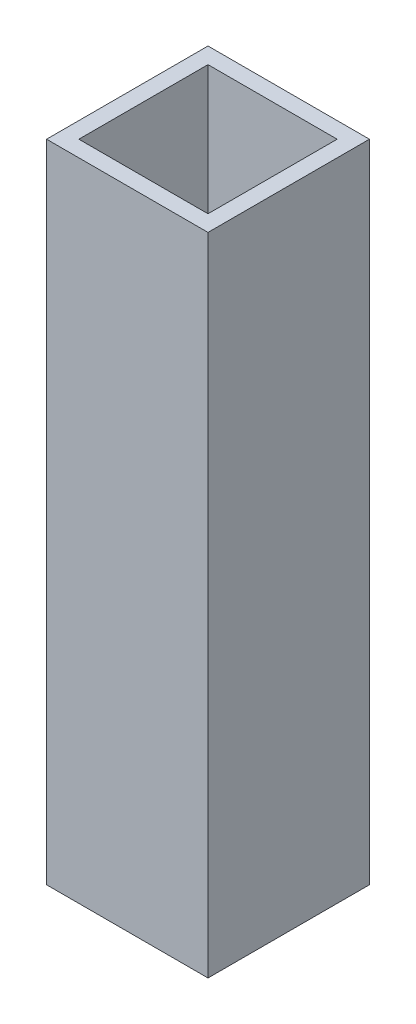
ISO-10303-21;
HEADER;
FILE_DESCRIPTION(('STEP AP214'),'2;1');
FILE_NAME('part.step','',(''),(''),'','','');
FILE_SCHEMA(('AUTOMOTIVE_DESIGN { 1 0 10303 214 1 1 1 1 }'));
ENDSEC;
DATA;
#1=APPLICATION_CONTEXT('core data for automotive mechanical design processes');
#2=APPLICATION_PROTOCOL_DEFINITION('international standard','automotive_design',2000,#1);
#3=PRODUCT_CONTEXT('',#1,'mechanical');
#4=PRODUCT('Part','Part','',(#3));
#5=PRODUCT_RELATED_PRODUCT_CATEGORY('part','',(#4));
#6=PRODUCT_DEFINITION_FORMATION('','',#4);
#7=PRODUCT_DEFINITION_CONTEXT('part definition',#1,'design');
#8=PRODUCT_DEFINITION('design','',#6,#7);
#9=PRODUCT_DEFINITION_SHAPE('','',#8);
#10=(LENGTH_UNIT() NAMED_UNIT(*) SI_UNIT(.MILLI.,.METRE.));
#11=(NAMED_UNIT(*) PLANE_ANGLE_UNIT() SI_UNIT($,.RADIAN.));
#12=(NAMED_UNIT(*) SI_UNIT($,.STERADIAN.) SOLID_ANGLE_UNIT());
#13=UNCERTAINTY_MEASURE_WITH_UNIT(LENGTH_MEASURE(1.E-05),#10,'distance_accuracy_value','');
#14=(GEOMETRIC_REPRESENTATION_CONTEXT(3) GLOBAL_UNCERTAINTY_ASSIGNED_CONTEXT((#13)) GLOBAL_UNIT_ASSIGNED_CONTEXT((#10,
#11,#12)) REPRESENTATION_CONTEXT('',''));
#15=CARTESIAN_POINT('',(0.,0.,0.));
#16=DIRECTION('',(0.,0.,1.));
#17=DIRECTION('',(1.,0.,0.));
#18=AXIS2_PLACEMENT_3D('',#15,#16,#17);
#19=CARTESIAN_POINT('',(0.,80.,0.));
#20=DIRECTION('',(0.,1.,0.));
#21=DIRECTION('',(0.,0.,1.));
#22=AXIS2_PLACEMENT_3D('',#19,#20,#21);
#23=PLANE('',#22);
#24=DIRECTION('',(0.,0.,-1.));
#25=VECTOR('',#24,1.);
#26=CARTESIAN_POINT('',(10.,80.,-10.));
#27=LINE('',#26,#25);
#28=CARTESIAN_POINT('',(10.,80.,10.));
#29=VERTEX_POINT('',#28);
#30=CARTESIAN_POINT('',(10.,80.,-10.));
#31=VERTEX_POINT('',#30);
#32=EDGE_CURVE('E136',#29,#31,#27,.T.);
#33=ORIENTED_EDGE('',*,*,#32,.T.);
#34=DIRECTION('',(-1.,0.,0.));
#35=VECTOR('',#34,1.);
#36=CARTESIAN_POINT('',(-10.,80.,-10.));
#37=LINE('',#36,#35);
#38=CARTESIAN_POINT('',(-10.,80.,-10.));
#39=VERTEX_POINT('',#38);
#40=EDGE_CURVE('E139',#31,#39,#37,.T.);
#41=ORIENTED_EDGE('',*,*,#40,.T.);
#42=DIRECTION('',(0.,0.,1.));
#43=VECTOR('',#42,1.);
#44=CARTESIAN_POINT('',(-10.,80.,-10.));
#45=LINE('',#44,#43);
#46=CARTESIAN_POINT('',(-10.,80.,10.));
#47=VERTEX_POINT('',#46);
#48=EDGE_CURVE('E142',#39,#47,#45,.T.);
#49=ORIENTED_EDGE('',*,*,#48,.T.);
#50=DIRECTION('',(1.,0.,0.));
#51=VECTOR('',#50,1.);
#52=CARTESIAN_POINT('',(-10.,80.,10.));
#53=LINE('',#52,#51);
#54=EDGE_CURVE('E144',#47,#29,#53,.T.);
#55=ORIENTED_EDGE('',*,*,#54,.T.);
#56=EDGE_LOOP('',(#33,#41,#49,#55));
#57=FACE_BOUND('',#56,.T.);
#58=DIRECTION('',(0.,0.,1.));
#59=VECTOR('',#58,1.);
#60=CARTESIAN_POINT('',(-8.,80.,-8.));
#61=LINE('',#60,#59);
#62=CARTESIAN_POINT('',(-8.,80.,-8.));
#63=VERTEX_POINT('',#62);
#64=CARTESIAN_POINT('',(-8.,80.,8.));
#65=VERTEX_POINT('',#64);
#66=EDGE_CURVE('E108',#63,#65,#61,.T.);
#67=ORIENTED_EDGE('',*,*,#66,.F.);
#68=DIRECTION('',(-1.,0.,0.));
#69=VECTOR('',#68,1.);
#70=CARTESIAN_POINT('',(-8.,80.,-8.));
#71=LINE('',#70,#69);
#72=CARTESIAN_POINT('',(8.,80.,-8.));
#73=VERTEX_POINT('',#72);
#74=EDGE_CURVE('E100',#73,#63,#71,.T.);
#75=ORIENTED_EDGE('',*,*,#74,.F.);
#76=DIRECTION('',(0.,0.,-1.));
#77=VECTOR('',#76,1.);
#78=CARTESIAN_POINT('',(8.,80.,-8.));
#79=LINE('',#78,#77);
#80=CARTESIAN_POINT('',(8.,80.,8.));
#81=VERTEX_POINT('',#80);
#82=EDGE_CURVE('E122',#81,#73,#79,.T.);
#83=ORIENTED_EDGE('',*,*,#82,.F.);
#84=DIRECTION('',(1.,0.,0.));
#85=VECTOR('',#84,1.);
#86=CARTESIAN_POINT('',(-8.,80.,8.));
#87=LINE('',#86,#85);
#88=EDGE_CURVE('E120',#65,#81,#87,.T.);
#89=ORIENTED_EDGE('',*,*,#88,.F.);
#90=EDGE_LOOP('',(#67,#75,#83,#89));
#91=FACE_BOUND('',#90,.T.);
#92=ADVANCED_FACE('F35',(#57,#91),#23,.T.);
#93=CARTESIAN_POINT('',(0.,0.,0.));
#94=DIRECTION('',(0.,1.,0.));
#95=DIRECTION('',(0.,0.,1.));
#96=AXIS2_PLACEMENT_3D('',#93,#94,#95);
#97=PLANE('',#96);
#98=DIRECTION('',(0.,0.,-1.));
#99=VECTOR('',#98,1.);
#100=CARTESIAN_POINT('',(10.,0.,-10.));
#101=LINE('',#100,#99);
#102=CARTESIAN_POINT('',(10.,0.,10.));
#103=VERTEX_POINT('',#102);
#104=CARTESIAN_POINT('',(10.,0.,-10.));
#105=VERTEX_POINT('',#104);
#106=EDGE_CURVE('E116',#103,#105,#101,.T.);
#107=ORIENTED_EDGE('',*,*,#106,.F.);
#108=DIRECTION('',(1.,0.,0.));
#109=VECTOR('',#108,1.);
#110=CARTESIAN_POINT('',(-10.,0.,10.));
#111=LINE('',#110,#109);
#112=CARTESIAN_POINT('',(-10.,0.,10.));
#113=VERTEX_POINT('',#112);
#114=EDGE_CURVE('E140',#113,#103,#111,.T.);
#115=ORIENTED_EDGE('',*,*,#114,.F.);
#116=DIRECTION('',(0.,0.,1.));
#117=VECTOR('',#116,1.);
#118=CARTESIAN_POINT('',(-10.,0.,-10.));
#119=LINE('',#118,#117);
#120=CARTESIAN_POINT('',(-10.,0.,-10.));
#121=VERTEX_POINT('',#120);
#122=EDGE_CURVE('E151',#121,#113,#119,.T.);
#123=ORIENTED_EDGE('',*,*,#122,.F.);
#124=DIRECTION('',(-1.,0.,0.));
#125=VECTOR('',#124,1.);
#126=CARTESIAN_POINT('',(-10.,0.,-10.));
#127=LINE('',#126,#125);
#128=EDGE_CURVE('E149',#105,#121,#127,.T.);
#129=ORIENTED_EDGE('',*,*,#128,.F.);
#130=EDGE_LOOP('',(#107,#115,#123,#129));
#131=FACE_BOUND('',#130,.T.);
#132=DIRECTION('',(-1.,0.,0.));
#133=VECTOR('',#132,1.);
#134=CARTESIAN_POINT('',(-8.,0.,-8.));
#135=LINE('',#134,#133);
#136=CARTESIAN_POINT('',(8.,0.,-8.));
#137=VERTEX_POINT('',#136);
#138=CARTESIAN_POINT('',(-8.,0.,-8.));
#139=VERTEX_POINT('',#138);
#140=EDGE_CURVE('E58',#137,#139,#135,.T.);
#141=ORIENTED_EDGE('',*,*,#140,.T.);
#142=DIRECTION('',(0.,0.,1.));
#143=VECTOR('',#142,1.);
#144=CARTESIAN_POINT('',(-8.,0.,-8.));
#145=LINE('',#144,#143);
#146=CARTESIAN_POINT('',(-8.,0.,8.));
#147=VERTEX_POINT('',#146);
#148=EDGE_CURVE('E115',#139,#147,#145,.T.);
#149=ORIENTED_EDGE('',*,*,#148,.T.);
#150=DIRECTION('',(1.,0.,0.));
#151=VECTOR('',#150,1.);
#152=CARTESIAN_POINT('',(-8.,0.,8.));
#153=LINE('',#152,#151);
#154=CARTESIAN_POINT('',(8.,0.,8.));
#155=VERTEX_POINT('',#154);
#156=EDGE_CURVE('E128',#147,#155,#153,.T.);
#157=ORIENTED_EDGE('',*,*,#156,.T.);
#158=DIRECTION('',(0.,0.,-1.));
#159=VECTOR('',#158,1.);
#160=CARTESIAN_POINT('',(8.,0.,-8.));
#161=LINE('',#160,#159);
#162=EDGE_CURVE('E109',#155,#137,#161,.T.);
#163=ORIENTED_EDGE('',*,*,#162,.T.);
#164=EDGE_LOOP('',(#141,#149,#157,#163));
#165=FACE_BOUND('',#164,.T.);
#166=ADVANCED_FACE('F169',(#131,#165),#97,.F.);
#167=CARTESIAN_POINT('',(10.,80.,-10.));
#168=DIRECTION('',(-1.,0.,0.));
#169=DIRECTION('',(0.,0.,1.));
#170=AXIS2_PLACEMENT_3D('',#167,#168,#169);
#171=PLANE('',#170);
#172=ORIENTED_EDGE('',*,*,#106,.T.);
#173=DIRECTION('',(0.,-1.,0.));
#174=VECTOR('',#173,1.);
#175=CARTESIAN_POINT('',(10.,80.,-10.));
#176=LINE('',#175,#174);
#177=EDGE_CURVE('E11',#31,#105,#176,.T.);
#178=ORIENTED_EDGE('',*,*,#177,.F.);
#179=ORIENTED_EDGE('',*,*,#32,.F.);
#180=DIRECTION('',(0.,-1.,0.));
#181=VECTOR('',#180,1.);
#182=CARTESIAN_POINT('',(10.,80.,10.));
#183=LINE('',#182,#181);
#184=EDGE_CURVE('E146',#29,#103,#183,.T.);
#185=ORIENTED_EDGE('',*,*,#184,.T.);
#186=EDGE_LOOP('',(#172,#178,#179,#185));
#187=FACE_BOUND('',#186,.T.);
#188=ADVANCED_FACE('F37',(#187),#171,.F.);
#189=CARTESIAN_POINT('',(-10.,80.,-10.));
#190=DIRECTION('',(0.,0.,1.));
#191=DIRECTION('',(1.,0.,0.));
#192=AXIS2_PLACEMENT_3D('',#189,#190,#191);
#193=PLANE('',#192);
#194=ORIENTED_EDGE('',*,*,#128,.T.);
#195=DIRECTION('',(0.,-1.,0.));
#196=VECTOR('',#195,1.);
#197=CARTESIAN_POINT('',(-10.,80.,-10.));
#198=LINE('',#197,#196);
#199=EDGE_CURVE('E43',#39,#121,#198,.T.);
#200=ORIENTED_EDGE('',*,*,#199,.F.);
#201=ORIENTED_EDGE('',*,*,#40,.F.);
#202=ORIENTED_EDGE('',*,*,#177,.T.);
#203=EDGE_LOOP('',(#194,#200,#201,#202));
#204=FACE_BOUND('',#203,.T.);
#205=ADVANCED_FACE('F179',(#204),#193,.F.);
#206=CARTESIAN_POINT('',(-10.,80.,-10.));
#207=DIRECTION('',(1.,0.,0.));
#208=DIRECTION('',(0.,0.,-1.));
#209=AXIS2_PLACEMENT_3D('',#206,#207,#208);
#210=PLANE('',#209);
#211=ORIENTED_EDGE('',*,*,#122,.T.);
#212=DIRECTION('',(0.,-1.,0.));
#213=VECTOR('',#212,1.);
#214=CARTESIAN_POINT('',(-10.,80.,10.));
#215=LINE('',#214,#213);
#216=EDGE_CURVE('E156',#47,#113,#215,.T.);
#217=ORIENTED_EDGE('',*,*,#216,.F.);
#218=ORIENTED_EDGE('',*,*,#48,.F.);
#219=ORIENTED_EDGE('',*,*,#199,.T.);
#220=EDGE_LOOP('',(#211,#217,#218,#219));
#221=FACE_BOUND('',#220,.T.);
#222=ADVANCED_FACE('F163',(#221),#210,.F.);
#223=CARTESIAN_POINT('',(-10.,80.,10.));
#224=DIRECTION('',(0.,0.,-1.));
#225=DIRECTION('',(-1.,0.,0.));
#226=AXIS2_PLACEMENT_3D('',#223,#224,#225);
#227=PLANE('',#226);
#228=ORIENTED_EDGE('',*,*,#114,.T.);
#229=ORIENTED_EDGE('',*,*,#184,.F.);
#230=ORIENTED_EDGE('',*,*,#54,.F.);
#231=ORIENTED_EDGE('',*,*,#216,.T.);
#232=EDGE_LOOP('',(#228,#229,#230,#231));
#233=FACE_BOUND('',#232,.T.);
#234=ADVANCED_FACE('F173',(#233),#227,.F.);
#235=CARTESIAN_POINT('',(-8.,80.,-8.));
#236=DIRECTION('',(0.,0.,1.));
#237=DIRECTION('',(1.,0.,0.));
#238=AXIS2_PLACEMENT_3D('',#235,#236,#237);
#239=PLANE('',#238);
#240=ORIENTED_EDGE('',*,*,#140,.F.);
#241=DIRECTION('',(0.,-1.,0.));
#242=VECTOR('',#241,1.);
#243=CARTESIAN_POINT('',(8.,80.,-8.));
#244=LINE('',#243,#242);
#245=EDGE_CURVE('E104',#73,#137,#244,.T.);
#246=ORIENTED_EDGE('',*,*,#245,.F.);
#247=ORIENTED_EDGE('',*,*,#74,.T.);
#248=DIRECTION('',(0.,-1.,0.));
#249=VECTOR('',#248,1.);
#250=CARTESIAN_POINT('',(-8.,80.,-8.));
#251=LINE('',#250,#249);
#252=EDGE_CURVE('E103',#63,#139,#251,.T.);
#253=ORIENTED_EDGE('',*,*,#252,.T.);
#254=EDGE_LOOP('',(#240,#246,#247,#253));
#255=FACE_BOUND('',#254,.T.);
#256=ADVANCED_FACE('F102',(#255),#239,.T.);
#257=CARTESIAN_POINT('',(-8.,80.,-8.));
#258=DIRECTION('',(1.,0.,0.));
#259=DIRECTION('',(0.,0.,-1.));
#260=AXIS2_PLACEMENT_3D('',#257,#258,#259);
#261=PLANE('',#260);
#262=ORIENTED_EDGE('',*,*,#148,.F.);
#263=ORIENTED_EDGE('',*,*,#252,.F.);
#264=ORIENTED_EDGE('',*,*,#66,.T.);
#265=DIRECTION('',(0.,-1.,0.));
#266=VECTOR('',#265,1.);
#267=CARTESIAN_POINT('',(-8.,80.,8.));
#268=LINE('',#267,#266);
#269=EDGE_CURVE('E117',#65,#147,#268,.T.);
#270=ORIENTED_EDGE('',*,*,#269,.T.);
#271=EDGE_LOOP('',(#262,#263,#264,#270));
#272=FACE_BOUND('',#271,.T.);
#273=ADVANCED_FACE('F112',(#272),#261,.T.);
#274=CARTESIAN_POINT('',(-8.,80.,8.));
#275=DIRECTION('',(0.,0.,-1.));
#276=DIRECTION('',(-1.,0.,0.));
#277=AXIS2_PLACEMENT_3D('',#274,#275,#276);
#278=PLANE('',#277);
#279=ORIENTED_EDGE('',*,*,#156,.F.);
#280=ORIENTED_EDGE('',*,*,#269,.F.);
#281=ORIENTED_EDGE('',*,*,#88,.T.);
#282=DIRECTION('',(0.,-1.,0.));
#283=VECTOR('',#282,1.);
#284=CARTESIAN_POINT('',(8.,80.,8.));
#285=LINE('',#284,#283);
#286=EDGE_CURVE('E50',#81,#155,#285,.T.);
#287=ORIENTED_EDGE('',*,*,#286,.T.);
#288=EDGE_LOOP('',(#279,#280,#281,#287));
#289=FACE_BOUND('',#288,.T.);
#290=ADVANCED_FACE('F202',(#289),#278,.T.);
#291=CARTESIAN_POINT('',(8.,80.,-8.));
#292=DIRECTION('',(-1.,0.,0.));
#293=DIRECTION('',(0.,0.,1.));
#294=AXIS2_PLACEMENT_3D('',#291,#292,#293);
#295=PLANE('',#294);
#296=ORIENTED_EDGE('',*,*,#162,.F.);
#297=ORIENTED_EDGE('',*,*,#286,.F.);
#298=ORIENTED_EDGE('',*,*,#82,.T.);
#299=ORIENTED_EDGE('',*,*,#245,.T.);
#300=EDGE_LOOP('',(#296,#297,#298,#299));
#301=FACE_BOUND('',#300,.T.);
#302=ADVANCED_FACE('F206',(#301),#295,.T.);
#303=CLOSED_SHELL('',(#92,#166,#188,#205,#222,#234,#256,#273,#290,#302));
#304=MANIFOLD_SOLID_BREP('B2',#303);
#305=ADVANCED_BREP_SHAPE_REPRESENTATION('',(#18,#304),#14);
#306=SHAPE_DEFINITION_REPRESENTATION(#9,#305);
ENDSEC;
END-ISO-10303-21;
